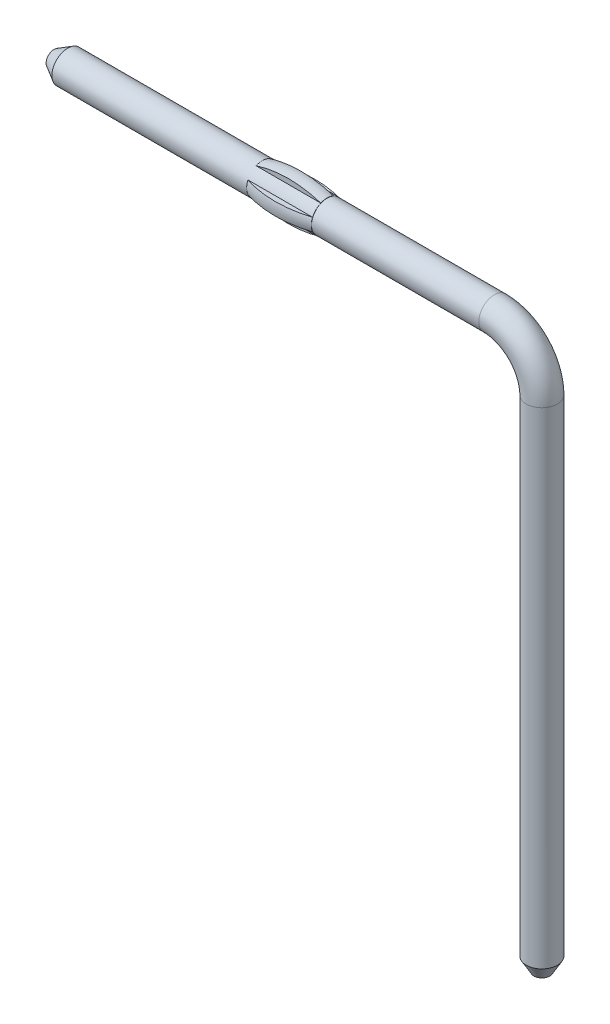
ISO-10303-21;
HEADER;
FILE_DESCRIPTION(('STEP AP214'),'2;1');
FILE_NAME('part.step','',(''),(''),'','','');
FILE_SCHEMA(('AUTOMOTIVE_DESIGN { 1 0 10303 214 1 1 1 1 }'));
ENDSEC;
DATA;
#1=APPLICATION_CONTEXT('core data for automotive mechanical design processes');
#2=APPLICATION_PROTOCOL_DEFINITION('international standard','automotive_design',2000,#1);
#3=PRODUCT_CONTEXT('',#1,'mechanical');
#4=PRODUCT('Part','Part','',(#3));
#5=PRODUCT_RELATED_PRODUCT_CATEGORY('part','',(#4));
#6=PRODUCT_DEFINITION_FORMATION('','',#4);
#7=PRODUCT_DEFINITION_CONTEXT('part definition',#1,'design');
#8=PRODUCT_DEFINITION('design','',#6,#7);
#9=PRODUCT_DEFINITION_SHAPE('','',#8);
#10=(LENGTH_UNIT() NAMED_UNIT(*) SI_UNIT(.MILLI.,.METRE.));
#11=(NAMED_UNIT(*) PLANE_ANGLE_UNIT() SI_UNIT($,.RADIAN.));
#12=(NAMED_UNIT(*) SI_UNIT($,.STERADIAN.) SOLID_ANGLE_UNIT());
#13=UNCERTAINTY_MEASURE_WITH_UNIT(LENGTH_MEASURE(1.E-05),#10,'distance_accuracy_value','');
#14=(GEOMETRIC_REPRESENTATION_CONTEXT(3) GLOBAL_UNCERTAINTY_ASSIGNED_CONTEXT((#13)) GLOBAL_UNIT_ASSIGNED_CONTEXT((#10,
#11,#12)) REPRESENTATION_CONTEXT('',''));
#15=CARTESIAN_POINT('',(0.,0.,0.));
#16=DIRECTION('',(0.,0.,1.));
#17=DIRECTION('',(1.,0.,0.));
#18=AXIS2_PLACEMENT_3D('',#15,#16,#17);
#19=CARTESIAN_POINT('',(-7.7,0.,0.));
#20=DIRECTION('',(1.,0.,0.));
#21=DIRECTION('',(0.,0.,-1.));
#22=AXIS2_PLACEMENT_3D('',#19,#20,#21);
#23=PLANE('',#22);
#24=CARTESIAN_POINT('',(-7.69999999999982,0.,0.));
#25=DIRECTION('',(1.,0.,0.));
#26=DIRECTION('',(0.,0.,-1.));
#27=AXIS2_PLACEMENT_3D('',#24,#25,#26);
#28=CIRCLE('',#27,0.12499999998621);
#29=CARTESIAN_POINT('',(-7.69999999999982,0.,-0.12499999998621));
#30=VERTEX_POINT('',#29);
#31=EDGE_CURVE('E21',#30,#30,#28,.T.);
#32=ORIENTED_EDGE('',*,*,#31,.F.);
#33=EDGE_LOOP('',(#32));
#34=FACE_BOUND('',#33,.T.);
#35=ADVANCED_FACE('F16',(#34),#23,.F.);
#36=CARTESIAN_POINT('',(-7.7,0.1,0.2291287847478));
#37=DIRECTION('',(0.,-1.,0.));
#38=DIRECTION('',(0.,0.,-1.));
#39=AXIS2_PLACEMENT_3D('',#36,#37,#38);
#40=PLANE('',#39);
#41=CARTESIAN_POINT('',(-3.39000000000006,0.1,0.229128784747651));
#42=CARTESIAN_POINT('',(-3.42100227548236,0.1,0.239288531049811));
#43=CARTESIAN_POINT('',(-3.45232127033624,0.1,0.248453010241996));
#44=CARTESIAN_POINT('',(-3.51545487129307,0.1,0.26483020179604));
#45=CARTESIAN_POINT('',(-3.54726930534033,0.1,0.272043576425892));
#46=CARTESIAN_POINT('',(-3.6435182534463,0.1,0.290870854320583));
#47=CARTESIAN_POINT('',(-3.7085269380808,0.1,0.299597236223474));
#48=CARTESIAN_POINT('',(-3.86808650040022,0.1,0.311579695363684));
#49=CARTESIAN_POINT('',(-3.96298668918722,0.1,0.310709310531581));
#50=CARTESIAN_POINT('',(-4.10398407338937,0.1,0.297494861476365));
#51=CARTESIAN_POINT('',(-4.15072624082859,0.1,0.29111365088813));
#52=CARTESIAN_POINT('',(-4.24348691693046,0.1,0.274376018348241));
#53=CARTESIAN_POINT('',(-4.28950587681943,0.1,0.264022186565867));
#54=CARTESIAN_POINT('',(-4.3601591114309,0.1,0.244758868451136));
#55=CARTESIAN_POINT('',(-4.385185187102,0.1,0.237261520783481));
#56=CARTESIAN_POINT('',(-4.41000000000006,0.1,0.22912878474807));
#57=B_SPLINE_CURVE_WITH_KNOTS('',3,(#41,#42,#43,#44,#45,#46,#47,#48,#49,#50,#51,#52,#53,#54,#55,
#56),.UNSPECIFIED.,.F.,.F.,(4,2,2,2,2,2,2,4),(0.,0.0978417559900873,0.19565025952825,
0.391991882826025,0.6751725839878,0.816569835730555,0.957875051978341,1.03621668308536),.UNSPECIFIED.);
#58=CARTESIAN_POINT('',(-3.39,0.0999999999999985,0.229128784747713));
#59=VERTEX_POINT('',#58);
#60=CARTESIAN_POINT('',(-4.40999999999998,0.0999999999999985,0.229128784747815));
#61=VERTEX_POINT('',#60);
#62=EDGE_CURVE('E118',#59,#61,#57,.T.);
#63=ORIENTED_EDGE('',*,*,#62,.F.);
#64=DIRECTION('',(1.,0.,0.));
#65=VECTOR('',#64,1.);
#66=CARTESIAN_POINT('',(-7.7,0.099999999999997,0.229128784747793));
#67=LINE('',#66,#65);
#68=EDGE_CURVE('E91',#61,#59,#67,.T.);
#69=ORIENTED_EDGE('',*,*,#68,.F.);
#70=EDGE_LOOP('',(#63,#69));
#71=FACE_BOUND('',#70,.T.);
#72=ADVANCED_FACE('F129',(#71),#40,.F.);
#73=CARTESIAN_POINT('',(-7.7,-0.1,0.2291287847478));
#74=DIRECTION('',(0.,-1.,0.));
#75=DIRECTION('',(0.,0.,-1.));
#76=AXIS2_PLACEMENT_3D('',#73,#74,#75);
#77=PLANE('',#76);
#78=DIRECTION('',(1.,0.,0.));
#79=VECTOR('',#78,1.);
#80=CARTESIAN_POINT('',(-7.7,-0.099999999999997,0.229128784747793));
#81=LINE('',#80,#79);
#82=CARTESIAN_POINT('',(-3.39,-0.0999999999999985,0.229128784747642));
#83=VERTEX_POINT('',#82);
#84=CARTESIAN_POINT('',(-4.40999999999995,-0.0999999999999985,0.229128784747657));
#85=VERTEX_POINT('',#84);
#86=EDGE_CURVE('E84',#83,#85,#81,.F.);
#87=ORIENTED_EDGE('',*,*,#86,.F.);
#88=CARTESIAN_POINT('',(-4.40999999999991,-0.1,0.22912878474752));
#89=CARTESIAN_POINT('',(-4.37899772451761,-0.1,0.239288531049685));
#90=CARTESIAN_POINT('',(-4.34767872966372,-0.1,0.248453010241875));
#91=CARTESIAN_POINT('',(-4.28454512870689,-0.1,0.264830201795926));
#92=CARTESIAN_POINT('',(-4.25273069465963,-0.1,0.272043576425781));
#93=CARTESIAN_POINT('',(-4.15648174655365,-0.1,0.290870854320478));
#94=CARTESIAN_POINT('',(-4.09147306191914,-0.1,0.299597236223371));
#95=CARTESIAN_POINT('',(-3.93191349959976,-0.1,0.311579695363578));
#96=CARTESIAN_POINT('',(-3.83701331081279,-0.1,0.310709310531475));
#97=CARTESIAN_POINT('',(-3.6960159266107,-0.1,0.297494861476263));
#98=CARTESIAN_POINT('',(-3.6492737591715,-0.1,0.29111365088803));
#99=CARTESIAN_POINT('',(-3.55651308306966,-0.1,0.274376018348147));
#100=CARTESIAN_POINT('',(-3.51049412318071,-0.1,0.264022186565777));
#101=CARTESIAN_POINT('',(-3.43984088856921,-0.1,0.244758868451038));
#102=CARTESIAN_POINT('',(-3.41481481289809,-0.1,0.237261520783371));
#103=CARTESIAN_POINT('',(-3.38999999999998,-0.1,0.229128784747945));
#104=B_SPLINE_CURVE_WITH_KNOTS('',3,(#88,#89,#90,#91,#92,#93,#94,#95,#96,#97,#98,#99,#100,#101,
#102,#103),.UNSPECIFIED.,.F.,.F.,(4,2,2,2,2,2,2,4),(0.,0.0978417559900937,0.195650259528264,
0.391991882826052,0.675172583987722,0.816569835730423,0.957875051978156,1.03621668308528),.UNSPECIFIED.);
#105=EDGE_CURVE('E87',#85,#83,#104,.T.);
#106=ORIENTED_EDGE('',*,*,#105,.F.);
#107=EDGE_LOOP('',(#87,#106));
#108=FACE_BOUND('',#107,.T.);
#109=ADVANCED_FACE('F85',(#108),#77,.T.);
#110=CARTESIAN_POINT('',(-7.7,-0.3092329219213,0.1));
#111=DIRECTION('',(0.,0.,1.));
#112=DIRECTION('',(1.,0.,0.));
#113=AXIS2_PLACEMENT_3D('',#110,#111,#112);
#114=PLANE('',#113);
#115=DIRECTION('',(1.,0.,0.));
#116=VECTOR('',#115,1.);
#117=CARTESIAN_POINT('',(-7.7,-0.229128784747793,0.0999999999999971));
#118=LINE('',#117,#116);
#119=CARTESIAN_POINT('',(-4.40999999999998,-0.229128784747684,0.0999999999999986));
#120=VERTEX_POINT('',#119);
#121=CARTESIAN_POINT('',(-3.39,-0.229128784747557,0.0999999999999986));
#122=VERTEX_POINT('',#121);
#123=EDGE_CURVE('E113',#120,#122,#118,.T.);
#124=ORIENTED_EDGE('',*,*,#123,.F.);
#125=CARTESIAN_POINT('',(-3.39000000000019,-0.229128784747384,0.1));
#126=CARTESIAN_POINT('',(-3.4210022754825,-0.239288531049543,0.1));
#127=CARTESIAN_POINT('',(-3.45232127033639,-0.248453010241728,0.1));
#128=CARTESIAN_POINT('',(-3.51545487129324,-0.264830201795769,0.1));
#129=CARTESIAN_POINT('',(-3.5472693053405,-0.27204357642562,0.1));
#130=CARTESIAN_POINT('',(-3.6435182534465,-0.290870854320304,0.1));
#131=CARTESIAN_POINT('',(-3.70852693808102,-0.29959723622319,0.1));
#132=CARTESIAN_POINT('',(-3.86808650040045,-0.31157969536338,0.1));
#133=CARTESIAN_POINT('',(-3.96298668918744,-0.310709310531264,0.1));
#134=CARTESIAN_POINT('',(-4.10398407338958,-0.297494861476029,0.1));
#135=CARTESIAN_POINT('',(-4.1507262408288,-0.291113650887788,0.1));
#136=CARTESIAN_POINT('',(-4.24348691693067,-0.274376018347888,0.1));
#137=CARTESIAN_POINT('',(-4.28950587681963,-0.264022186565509,0.1));
#138=CARTESIAN_POINT('',(-4.360159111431,-0.244758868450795,0.1));
#139=CARTESIAN_POINT('',(-4.385185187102,-0.237261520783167,0.1));
#140=CARTESIAN_POINT('',(-4.40999999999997,-0.229128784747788,0.1));
#141=B_SPLINE_CURVE_WITH_KNOTS('',3,(#125,#126,#127,#128,#129,#130,#131,#132,#133,#134,#135,
#136,#137,#138,#139,#140),.UNSPECIFIED.,.F.,.F.,(4,2,2,2,2,2,2,4),(0.,0.0978417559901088,
0.195650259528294,0.391991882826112,0.675172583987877,0.816569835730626,0.957875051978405,
1.03621668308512),.UNSPECIFIED.);
#142=EDGE_CURVE('E107',#122,#120,#141,.T.);
#143=ORIENTED_EDGE('',*,*,#142,.F.);
#144=EDGE_LOOP('',(#124,#143));
#145=FACE_BOUND('',#144,.T.);
#146=ADVANCED_FACE('F156',(#145),#114,.T.);
#147=CARTESIAN_POINT('',(-7.7,-0.3092329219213,-0.1));
#148=DIRECTION('',(0.,0.,1.));
#149=DIRECTION('',(1.,0.,0.));
#150=AXIS2_PLACEMENT_3D('',#147,#148,#149);
#151=PLANE('',#150);
#152=CARTESIAN_POINT('',(-4.40999999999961,-0.229128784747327,-0.1));
#153=CARTESIAN_POINT('',(-4.3789977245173,-0.23928853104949,-0.1));
#154=CARTESIAN_POINT('',(-4.34767872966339,-0.248453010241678,-0.1));
#155=CARTESIAN_POINT('',(-4.28454512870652,-0.264830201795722,-0.1));
#156=CARTESIAN_POINT('',(-4.25273069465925,-0.272043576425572,-0.1));
#157=CARTESIAN_POINT('',(-4.15648174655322,-0.290870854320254,-0.1));
#158=CARTESIAN_POINT('',(-4.09147306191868,-0.299597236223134,-0.1));
#159=CARTESIAN_POINT('',(-3.93191349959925,-0.311579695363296,-0.1));
#160=CARTESIAN_POINT('',(-3.83701331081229,-0.310709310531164,-0.1));
#161=CARTESIAN_POINT('',(-3.6960159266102,-0.29749486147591,-0.1));
#162=CARTESIAN_POINT('',(-3.649273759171,-0.291113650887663,-0.1));
#163=CARTESIAN_POINT('',(-3.55651308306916,-0.274376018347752,-0.1));
#164=CARTESIAN_POINT('',(-3.51049412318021,-0.264022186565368,-0.1));
#165=CARTESIAN_POINT('',(-3.43984088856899,-0.244758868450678,-0.1));
#166=CARTESIAN_POINT('',(-3.41481481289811,-0.237261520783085,-0.1));
#167=CARTESIAN_POINT('',(-3.39000000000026,-0.229128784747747,-0.1));
#168=B_SPLINE_CURVE_WITH_KNOTS('',3,(#152,#153,#154,#155,#156,#157,#158,#159,#160,#161,#162,
#163,#164,#165,#166,#167),.UNSPECIFIED.,.F.,.F.,(4,2,2,2,2,2,2,4),(0.,0.0978417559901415,
0.195650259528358,0.391991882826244,0.675172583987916,0.816569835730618,0.95787505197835,
1.03621668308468),.UNSPECIFIED.);
#169=CARTESIAN_POINT('',(-4.40999999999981,-0.22912878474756,-0.0999999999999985));
#170=VERTEX_POINT('',#169);
#171=CARTESIAN_POINT('',(-3.39000000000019,-0.229128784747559,-0.0999999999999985));
#172=VERTEX_POINT('',#171);
#173=EDGE_CURVE('E145',#170,#172,#168,.T.);
#174=ORIENTED_EDGE('',*,*,#173,.F.);
#175=DIRECTION('',(1.,0.,0.));
#176=VECTOR('',#175,1.);
#177=CARTESIAN_POINT('',(-7.7,-0.229128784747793,-0.0999999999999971));
#178=LINE('',#177,#176);
#179=EDGE_CURVE('E216',#172,#170,#178,.F.);
#180=ORIENTED_EDGE('',*,*,#179,.F.);
#181=EDGE_LOOP('',(#174,#180));
#182=FACE_BOUND('',#181,.T.);
#183=ADVANCED_FACE('F159',(#182),#151,.F.);
#184=CARTESIAN_POINT('',(-7.48349364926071,0.,0.));
#185=DIRECTION('',(1.,0.,0.));
#186=DIRECTION('',(0.,0.,-1.));
#187=AXIS2_PLACEMENT_3D('',#184,#185,#186);
#188=CONICAL_SURFACE('',#187,0.249999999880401,0.523598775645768);
#189=CARTESIAN_POINT('',(-7.483493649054,0.,0.));
#190=DIRECTION('',(1.,0.,0.));
#191=DIRECTION('',(0.,0.,-1.));
#192=AXIS2_PLACEMENT_3D('',#189,#190,#191);
#193=CIRCLE('',#192,0.25);
#194=CARTESIAN_POINT('',(-7.483493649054,0.,-0.25));
#195=VERTEX_POINT('',#194);
#196=EDGE_CURVE('E210',#195,#195,#193,.T.);
#197=ORIENTED_EDGE('',*,*,#196,.F.);
#198=EDGE_LOOP('',(#197));
#199=FACE_BOUND('',#198,.T.);
#200=ORIENTED_EDGE('',*,*,#31,.T.);
#201=EDGE_LOOP('',(#200));
#202=FACE_BOUND('',#201,.T.);
#203=ADVANCED_FACE('F296',(#199,#202),#188,.T.);
#204=CARTESIAN_POINT('',(-7.7,0.1,-0.2291287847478));
#205=DIRECTION('',(0.,1.,0.));
#206=DIRECTION('',(0.,0.,1.));
#207=AXIS2_PLACEMENT_3D('',#204,#205,#206);
#208=PLANE('',#207);
#209=DIRECTION('',(1.,0.,0.));
#210=VECTOR('',#209,1.);
#211=CARTESIAN_POINT('',(-7.7,0.0999999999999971,-0.229128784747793));
#212=LINE('',#211,#210);
#213=CARTESIAN_POINT('',(-3.39000000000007,0.0999999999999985,-0.229128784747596));
#214=VERTEX_POINT('',#213);
#215=CARTESIAN_POINT('',(-4.40999999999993,0.0999999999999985,-0.229128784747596));
#216=VERTEX_POINT('',#215);
#217=EDGE_CURVE('E209',#214,#216,#212,.F.);
#218=ORIENTED_EDGE('',*,*,#217,.F.);
#219=CARTESIAN_POINT('',(-4.40999999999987,0.1,-0.229128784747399));
#220=CARTESIAN_POINT('',(-4.37899772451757,0.1,-0.239288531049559));
#221=CARTESIAN_POINT('',(-4.34767872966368,0.1,-0.248453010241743));
#222=CARTESIAN_POINT('',(-4.28454512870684,0.1,-0.264830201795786));
#223=CARTESIAN_POINT('',(-4.25273069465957,0.1,-0.272043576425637));
#224=CARTESIAN_POINT('',(-4.15648174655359,0.1,-0.290870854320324));
#225=CARTESIAN_POINT('',(-4.09147306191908,0.1,-0.299597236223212));
#226=CARTESIAN_POINT('',(-3.93191349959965,0.1,-0.311579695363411));
#227=CARTESIAN_POINT('',(-3.83701331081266,0.1,-0.310709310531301));
#228=CARTESIAN_POINT('',(-3.69601592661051,0.1,-0.297494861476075));
#229=CARTESIAN_POINT('',(-3.64927375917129,0.1,-0.291113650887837));
#230=CARTESIAN_POINT('',(-3.55651308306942,0.1,-0.274376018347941));
#231=CARTESIAN_POINT('',(-3.51049412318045,0.1,-0.264022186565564));
#232=CARTESIAN_POINT('',(-3.43984088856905,0.1,-0.244758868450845));
#233=CARTESIAN_POINT('',(-3.41481481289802,0.1,-0.23726152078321));
#234=CARTESIAN_POINT('',(-3.39000000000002,0.1,-0.229128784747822));
#235=B_SPLINE_CURVE_WITH_KNOTS('',3,(#219,#220,#221,#222,#223,#224,#225,#226,#227,#228,#229,
#230,#231,#232,#233,#234),.UNSPECIFIED.,.F.,.F.,(4,2,2,2,2,2,2,4),(0.,0.0978417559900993,
0.195650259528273,0.391991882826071,0.675172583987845,0.816569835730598,0.957875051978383,
1.0362166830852),.UNSPECIFIED.);
#236=EDGE_CURVE('E220',#216,#214,#235,.T.);
#237=ORIENTED_EDGE('',*,*,#236,.F.);
#238=EDGE_LOOP('',(#218,#237));
#239=FACE_BOUND('',#238,.T.);
#240=ADVANCED_FACE('F271',(#239),#208,.T.);
#241=CARTESIAN_POINT('',(-7.7,-0.1,-0.2291287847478));
#242=DIRECTION('',(0.,1.,0.));
#243=DIRECTION('',(0.,0.,1.));
#244=AXIS2_PLACEMENT_3D('',#241,#242,#243);
#245=PLANE('',#244);
#246=CARTESIAN_POINT('',(-3.3900000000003,-0.1,-0.229128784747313));
#247=CARTESIAN_POINT('',(-3.42100227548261,-0.1,-0.239288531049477));
#248=CARTESIAN_POINT('',(-3.45232127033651,-0.1,-0.248453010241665));
#249=CARTESIAN_POINT('',(-3.51545487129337,-0.1,-0.264830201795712));
#250=CARTESIAN_POINT('',(-3.54726930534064,-0.1,-0.272043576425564));
#251=CARTESIAN_POINT('',(-3.64351825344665,-0.1,-0.29087085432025));
#252=CARTESIAN_POINT('',(-3.70852693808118,-0.1,-0.299597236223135));
#253=CARTESIAN_POINT('',(-3.8680865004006,-0.1,-0.31157969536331));
#254=CARTESIAN_POINT('',(-3.96298668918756,-0.1,-0.310709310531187));
#255=CARTESIAN_POINT('',(-4.10398407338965,-0.1,-0.297494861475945));
#256=CARTESIAN_POINT('',(-4.15072624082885,-0.1,-0.291113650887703));
#257=CARTESIAN_POINT('',(-4.24348691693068,-0.1,-0.274376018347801));
#258=CARTESIAN_POINT('',(-4.28950587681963,-0.1,-0.264022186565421));
#259=CARTESIAN_POINT('',(-4.36015911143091,-0.1,-0.244758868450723));
#260=CARTESIAN_POINT('',(-4.38518518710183,-0.1,-0.237261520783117));
#261=CARTESIAN_POINT('',(-4.40999999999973,-0.1,-0.229128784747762));
#262=B_SPLINE_CURVE_WITH_KNOTS('',3,(#246,#247,#248,#249,#250,#251,#252,#253,#254,#255,#256,
#257,#258,#259,#260,#261),.UNSPECIFIED.,.F.,.F.,(4,2,2,2,2,2,2,4),(0.,0.0978417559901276,
0.195650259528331,0.391991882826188,0.675172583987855,0.816569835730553,0.957875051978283,
1.03621668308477),.UNSPECIFIED.);
#263=CARTESIAN_POINT('',(-3.39000000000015,-0.0999999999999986,-0.229128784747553));
#264=VERTEX_POINT('',#263);
#265=CARTESIAN_POINT('',(-4.40999999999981,-0.0999999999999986,-0.229128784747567));
#266=VERTEX_POINT('',#265);
#267=EDGE_CURVE('E274',#264,#266,#262,.T.);
#268=ORIENTED_EDGE('',*,*,#267,.F.);
#269=DIRECTION('',(1.,0.,0.));
#270=VECTOR('',#269,1.);
#271=CARTESIAN_POINT('',(-7.7,-0.0999999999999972,-0.229128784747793));
#272=LINE('',#271,#270);
#273=EDGE_CURVE('E214',#266,#264,#272,.T.);
#274=ORIENTED_EDGE('',*,*,#273,.F.);
#275=EDGE_LOOP('',(#268,#274));
#276=FACE_BOUND('',#275,.T.);
#277=ADVANCED_FACE('F267',(#276),#245,.F.);
#278=CARTESIAN_POINT('',(-7.7,0.3092329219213,-0.1));
#279=DIRECTION('',(0.,0.,-1.));
#280=DIRECTION('',(-1.,0.,0.));
#281=AXIS2_PLACEMENT_3D('',#278,#279,#280);
#282=PLANE('',#281);
#283=DIRECTION('',(1.,0.,0.));
#284=VECTOR('',#283,1.);
#285=CARTESIAN_POINT('',(-7.7,0.229128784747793,-0.0999999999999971));
#286=LINE('',#285,#284);
#287=CARTESIAN_POINT('',(-4.40999999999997,0.229128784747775,-0.0999999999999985));
#288=VERTEX_POINT('',#287);
#289=CARTESIAN_POINT('',(-3.39000000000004,0.229128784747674,-0.0999999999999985));
#290=VERTEX_POINT('',#289);
#291=EDGE_CURVE('E207',#288,#290,#286,.T.);
#292=ORIENTED_EDGE('',*,*,#291,.F.);
#293=CARTESIAN_POINT('',(-3.39000000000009,0.229128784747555,-0.1));
#294=CARTESIAN_POINT('',(-3.42100227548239,0.23928853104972,-0.1));
#295=CARTESIAN_POINT('',(-3.45232127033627,0.248453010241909,-0.1));
#296=CARTESIAN_POINT('',(-3.51545487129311,0.26483020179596,-0.1));
#297=CARTESIAN_POINT('',(-3.54726930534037,0.272043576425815,-0.1));
#298=CARTESIAN_POINT('',(-3.64351825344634,0.290870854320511,-0.1));
#299=CARTESIAN_POINT('',(-3.70852693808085,0.299597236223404,-0.1));
#300=CARTESIAN_POINT('',(-3.86808650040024,0.311579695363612,-0.1));
#301=CARTESIAN_POINT('',(-3.96298668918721,0.310709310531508,-0.1));
#302=CARTESIAN_POINT('',(-4.1039840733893,0.297494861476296,-0.1));
#303=CARTESIAN_POINT('',(-4.15072624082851,0.291113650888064,-0.1));
#304=CARTESIAN_POINT('',(-4.24348691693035,0.27437601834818,-0.1));
#305=CARTESIAN_POINT('',(-4.2895058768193,0.264022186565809,-0.1));
#306=CARTESIAN_POINT('',(-4.3601591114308,0.24475886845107,-0.1));
#307=CARTESIAN_POINT('',(-4.38518518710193,0.237261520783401,-0.1));
#308=CARTESIAN_POINT('',(-4.41000000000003,0.229128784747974,-0.1));
#309=B_SPLINE_CURVE_WITH_KNOTS('',3,(#293,#294,#295,#296,#297,#298,#299,#300,#301,#302,#303,
#304,#305,#306,#307,#308),.UNSPECIFIED.,.F.,.F.,(4,2,2,2,2,2,2,4),(0.,0.0978417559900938,
0.195650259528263,0.39199188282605,0.675172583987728,0.816569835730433,0.95787505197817,
1.03621668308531),.UNSPECIFIED.);
#310=EDGE_CURVE('E35',#290,#288,#309,.T.);
#311=ORIENTED_EDGE('',*,*,#310,.F.);
#312=EDGE_LOOP('',(#292,#311));
#313=FACE_BOUND('',#312,.T.);
#314=ADVANCED_FACE('F262',(#313),#282,.T.);
#315=CARTESIAN_POINT('',(-7.7,0.3092329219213,0.1));
#316=DIRECTION('',(0.,0.,-1.));
#317=DIRECTION('',(-1.,0.,0.));
#318=AXIS2_PLACEMENT_3D('',#315,#316,#317);
#319=PLANE('',#318);
#320=CARTESIAN_POINT('',(-4.40999999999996,0.22912878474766,0.1));
#321=CARTESIAN_POINT('',(-4.37899772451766,0.239288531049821,0.1));
#322=CARTESIAN_POINT('',(-4.34767872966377,0.248453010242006,0.1));
#323=CARTESIAN_POINT('',(-4.28454512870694,0.264830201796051,0.1));
#324=CARTESIAN_POINT('',(-4.25273069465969,0.272043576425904,0.1));
#325=CARTESIAN_POINT('',(-4.15648174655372,0.290870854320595,0.1));
#326=CARTESIAN_POINT('',(-4.09147306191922,0.299597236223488,0.1));
#327=CARTESIAN_POINT('',(-3.9319134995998,0.311579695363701,0.1));
#328=CARTESIAN_POINT('',(-3.83701331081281,0.310709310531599,0.1));
#329=CARTESIAN_POINT('',(-3.69601592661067,0.297494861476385,0.1));
#330=CARTESIAN_POINT('',(-3.64927375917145,0.291113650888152,0.1));
#331=CARTESIAN_POINT('',(-3.55651308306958,0.274376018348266,0.1));
#332=CARTESIAN_POINT('',(-3.51049412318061,0.264022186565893,0.1));
#333=CARTESIAN_POINT('',(-3.43984088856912,0.24475886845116,0.1));
#334=CARTESIAN_POINT('',(-3.41481481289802,0.237261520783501,0.1));
#335=CARTESIAN_POINT('',(-3.38999999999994,0.229128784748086,0.1));
#336=B_SPLINE_CURVE_WITH_KNOTS('',3,(#320,#321,#322,#323,#324,#325,#326,#327,#328,#329,#330,
#331,#332,#333,#334,#335),.UNSPECIFIED.,.F.,.F.,(4,2,2,2,2,2,2,4),(0.,0.0978417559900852,
0.195650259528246,0.391991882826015,0.675172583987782,0.816569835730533,0.957875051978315,
1.03621668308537),.UNSPECIFIED.);
#337=CARTESIAN_POINT('',(-4.41,0.229128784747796,0.1));
#338=VERTEX_POINT('',#337);
#339=CARTESIAN_POINT('',(-3.39000000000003,0.229128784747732,0.1));
#340=VERTEX_POINT('',#339);
#341=EDGE_CURVE('E103',#338,#340,#336,.T.);
#342=ORIENTED_EDGE('',*,*,#341,.F.);
#343=DIRECTION('',(-1.,0.,0.));
#344=VECTOR('',#343,1.);
#345=CARTESIAN_POINT('',(-7.7,0.2291287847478,0.1));
#346=LINE('',#345,#344);
#347=EDGE_CURVE('E117',#340,#338,#346,.T.);
#348=ORIENTED_EDGE('',*,*,#347,.F.);
#349=EDGE_LOOP('',(#342,#348));
#350=FACE_BOUND('',#349,.T.);
#351=ADVANCED_FACE('F136',(#350),#319,.F.);
#352=CARTESIAN_POINT('',(-3.9,1.62847166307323E-13,1.37693675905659E-13));
#353=DIRECTION('',(1.,0.,0.));
#354=DIRECTION('',(0.,0.,-1.));
#355=AXIS2_PLACEMENT_3D('',#352,#353,#354);
#356=DEGENERATE_TOROIDAL_SURFACE('',#355,1.44649999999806,1.77149999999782,.F.);
#357=ORIENTED_EDGE('',*,*,#105,.T.);
#358=CARTESIAN_POINT('',(-3.39,1.62847166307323E-13,1.37693675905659E-13));
#359=DIRECTION('',(1.,0.,0.));
#360=DIRECTION('',(0.,0.,-1.));
#361=AXIS2_PLACEMENT_3D('',#358,#359,#360);
#362=CIRCLE('',#361,0.249999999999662);
#363=EDGE_CURVE('E94',#59,#83,#362,.T.);
#364=ORIENTED_EDGE('',*,*,#363,.F.);
#365=ORIENTED_EDGE('',*,*,#62,.T.);
#366=CARTESIAN_POINT('',(-4.40999999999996,1.39604582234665E-13,1.10900329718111E-13));
#367=DIRECTION('',(1.,0.,0.));
#368=DIRECTION('',(0.,1.,0.));
#369=AXIS2_PLACEMENT_3D('',#366,#367,#368);
#370=CIRCLE('',#369,0.249999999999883);
#371=EDGE_CURVE('E106',#61,#85,#370,.T.);
#372=ORIENTED_EDGE('',*,*,#371,.T.);
#373=EDGE_LOOP('',(#357,#364,#365,#372));
#374=FACE_BOUND('',#373,.T.);
#375=ADVANCED_FACE('F105',(#374),#356,.F.);
#376=CARTESIAN_POINT('',(-3.9,1.62847166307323E-13,1.37693675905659E-13));
#377=DIRECTION('',(1.,0.,0.));
#378=DIRECTION('',(0.,0.,-1.));
#379=AXIS2_PLACEMENT_3D('',#376,#377,#378);
#380=DEGENERATE_TOROIDAL_SURFACE('',#379,1.44649999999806,1.77149999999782,.F.);
#381=ORIENTED_EDGE('',*,*,#173,.T.);
#382=CARTESIAN_POINT('',(-3.39,1.62847166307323E-13,1.37693675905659E-13));
#383=DIRECTION('',(1.,0.,0.));
#384=DIRECTION('',(0.,0.,-1.));
#385=AXIS2_PLACEMENT_3D('',#382,#383,#384);
#386=CIRCLE('',#385,0.249999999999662);
#387=EDGE_CURVE('E102',#122,#172,#386,.T.);
#388=ORIENTED_EDGE('',*,*,#387,.F.);
#389=ORIENTED_EDGE('',*,*,#142,.T.);
#390=CARTESIAN_POINT('',(-4.41,0.,0.));
#391=DIRECTION('',(1.,0.,0.));
#392=DIRECTION('',(0.,0.,-1.));
#393=AXIS2_PLACEMENT_3D('',#390,#391,#392);
#394=CIRCLE('',#393,0.25);
#395=EDGE_CURVE('E219',#170,#120,#394,.F.);
#396=ORIENTED_EDGE('',*,*,#395,.F.);
#397=EDGE_LOOP('',(#381,#388,#389,#396));
#398=FACE_BOUND('',#397,.T.);
#399=ADVANCED_FACE('F135',(#398),#380,.F.);
#400=CARTESIAN_POINT('',(-3.9,1.62847166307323E-13,1.37693675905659E-13));
#401=DIRECTION('',(1.,0.,0.));
#402=DIRECTION('',(0.,0.,-1.));
#403=AXIS2_PLACEMENT_3D('',#400,#401,#402);
#404=DEGENERATE_TOROIDAL_SURFACE('',#403,1.44649999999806,1.77149999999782,.F.);
#405=ORIENTED_EDGE('',*,*,#236,.T.);
#406=CARTESIAN_POINT('',(-3.39000000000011,1.62847166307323E-13,1.37693675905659E-13));
#407=DIRECTION('',(1.,0.,0.));
#408=DIRECTION('',(0.,0.,-1.));
#409=AXIS2_PLACEMENT_3D('',#406,#407,#408);
#410=CIRCLE('',#409,0.249999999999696);
#411=EDGE_CURVE('E241',#264,#214,#410,.T.);
#412=ORIENTED_EDGE('',*,*,#411,.F.);
#413=ORIENTED_EDGE('',*,*,#267,.T.);
#414=CARTESIAN_POINT('',(-4.41,0.,0.));
#415=DIRECTION('',(1.,0.,0.));
#416=DIRECTION('',(0.,0.,-1.));
#417=AXIS2_PLACEMENT_3D('',#414,#415,#416);
#418=CIRCLE('',#417,0.25);
#419=EDGE_CURVE('E213',#216,#266,#418,.F.);
#420=ORIENTED_EDGE('',*,*,#419,.F.);
#421=EDGE_LOOP('',(#405,#412,#413,#420));
#422=FACE_BOUND('',#421,.T.);
#423=ADVANCED_FACE('F140',(#422),#404,.F.);
#424=CARTESIAN_POINT('',(-7.7,0.,0.));
#425=DIRECTION('',(1.,0.,0.));
#426=DIRECTION('',(0.,0.,-1.));
#427=AXIS2_PLACEMENT_3D('',#424,#425,#426);
#428=CYLINDRICAL_SURFACE('',#427,0.25);
#429=ORIENTED_EDGE('',*,*,#196,.T.);
#430=EDGE_LOOP('',(#429));
#431=FACE_BOUND('',#430,.T.);
#432=ORIENTED_EDGE('',*,*,#273,.T.);
#433=CARTESIAN_POINT('',(-3.39,0.,0.));
#434=DIRECTION('',(1.,0.,0.));
#435=DIRECTION('',(0.,0.,-1.));
#436=AXIS2_PLACEMENT_3D('',#433,#434,#435);
#437=CIRCLE('',#436,0.25);
#438=EDGE_CURVE('E244',#172,#264,#437,.T.);
#439=ORIENTED_EDGE('',*,*,#438,.F.);
#440=ORIENTED_EDGE('',*,*,#179,.T.);
#441=ORIENTED_EDGE('',*,*,#395,.T.);
#442=ORIENTED_EDGE('',*,*,#123,.T.);
#443=CARTESIAN_POINT('',(-3.39,0.,0.));
#444=DIRECTION('',(1.,0.,0.));
#445=DIRECTION('',(0.,0.,-1.));
#446=AXIS2_PLACEMENT_3D('',#443,#444,#445);
#447=CIRCLE('',#446,0.25);
#448=EDGE_CURVE('E79',#122,#83,#447,.F.);
#449=ORIENTED_EDGE('',*,*,#448,.T.);
#450=ORIENTED_EDGE('',*,*,#86,.T.);
#451=ORIENTED_EDGE('',*,*,#371,.F.);
#452=ORIENTED_EDGE('',*,*,#68,.T.);
#453=CARTESIAN_POINT('',(-3.39,0.,0.));
#454=DIRECTION('',(1.,0.,0.));
#455=DIRECTION('',(0.,0.,-1.));
#456=AXIS2_PLACEMENT_3D('',#453,#454,#455);
#457=CIRCLE('',#456,0.25);
#458=EDGE_CURVE('E98',#59,#340,#457,.F.);
#459=ORIENTED_EDGE('',*,*,#458,.T.);
#460=ORIENTED_EDGE('',*,*,#347,.T.);
#461=CARTESIAN_POINT('',(-4.40999999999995,1.38561037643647E-13,1.09585734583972E-13));
#462=DIRECTION('',(1.,0.,0.));
#463=DIRECTION('',(0.,1.,0.));
#464=AXIS2_PLACEMENT_3D('',#461,#462,#463);
#465=CIRCLE('',#464,0.249999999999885);
#466=EDGE_CURVE('E202',#288,#338,#465,.T.);
#467=ORIENTED_EDGE('',*,*,#466,.F.);
#468=ORIENTED_EDGE('',*,*,#291,.T.);
#469=CARTESIAN_POINT('',(-3.39,0.,0.));
#470=DIRECTION('',(1.,0.,0.));
#471=DIRECTION('',(0.,0.,-1.));
#472=AXIS2_PLACEMENT_3D('',#469,#470,#471);
#473=CIRCLE('',#472,0.25);
#474=EDGE_CURVE('E239',#214,#290,#473,.T.);
#475=ORIENTED_EDGE('',*,*,#474,.F.);
#476=ORIENTED_EDGE('',*,*,#217,.T.);
#477=ORIENTED_EDGE('',*,*,#419,.T.);
#478=EDGE_LOOP('',(#432,#439,#440,#441,#442,#449,#450,#451,#452,#459,#460,#467,#468,#475,#476,#477));
#479=FACE_BOUND('',#478,.T.);
#480=ADVANCED_FACE('F111',(#431,#479),#428,.T.);
#481=CARTESIAN_POINT('',(-3.9,1.62847166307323E-13,1.37693675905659E-13));
#482=DIRECTION('',(1.,0.,0.));
#483=DIRECTION('',(0.,0.,-1.));
#484=AXIS2_PLACEMENT_3D('',#481,#482,#483);
#485=DEGENERATE_TOROIDAL_SURFACE('',#484,1.44649999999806,1.77149999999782,.F.);
#486=ORIENTED_EDGE('',*,*,#341,.T.);
#487=CARTESIAN_POINT('',(-3.39,1.62847166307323E-13,1.37693675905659E-13));
#488=DIRECTION('',(1.,0.,0.));
#489=DIRECTION('',(0.,0.,-1.));
#490=AXIS2_PLACEMENT_3D('',#487,#488,#489);
#491=CIRCLE('',#490,0.249999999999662);
#492=EDGE_CURVE('E237',#290,#340,#491,.T.);
#493=ORIENTED_EDGE('',*,*,#492,.F.);
#494=ORIENTED_EDGE('',*,*,#310,.T.);
#495=ORIENTED_EDGE('',*,*,#466,.T.);
#496=EDGE_LOOP('',(#486,#493,#494,#495));
#497=FACE_BOUND('',#496,.T.);
#498=ADVANCED_FACE('F18',(#497),#485,.F.);
#499=CARTESIAN_POINT('',(-3.39,0.,0.));
#500=DIRECTION('',(1.,0.,0.));
#501=DIRECTION('',(0.,0.,-1.));
#502=AXIS2_PLACEMENT_3D('',#499,#500,#501);
#503=PLANE('',#502);
#504=CARTESIAN_POINT('',(-3.39,0.,0.));
#505=DIRECTION('',(1.,0.,0.));
#506=DIRECTION('',(0.,0.,-1.));
#507=AXIS2_PLACEMENT_3D('',#504,#505,#506);
#508=CIRCLE('',#507,0.246);
#509=CARTESIAN_POINT('',(-3.39,0.,-0.246));
#510=VERTEX_POINT('',#509);
#511=EDGE_CURVE('E201',#510,#510,#508,.T.);
#512=ORIENTED_EDGE('',*,*,#511,.F.);
#513=EDGE_LOOP('',(#512));
#514=FACE_BOUND('',#513,.T.);
#515=ORIENTED_EDGE('',*,*,#474,.T.);
#516=ORIENTED_EDGE('',*,*,#492,.T.);
#517=ORIENTED_EDGE('',*,*,#458,.F.);
#518=ORIENTED_EDGE('',*,*,#363,.T.);
#519=ORIENTED_EDGE('',*,*,#448,.F.);
#520=ORIENTED_EDGE('',*,*,#387,.T.);
#521=ORIENTED_EDGE('',*,*,#438,.T.);
#522=ORIENTED_EDGE('',*,*,#411,.T.);
#523=EDGE_LOOP('',(#515,#516,#517,#518,#519,#520,#521,#522));
#524=FACE_BOUND('',#523,.T.);
#525=ADVANCED_FACE('F96',(#514,#524),#503,.T.);
#526=CARTESIAN_POINT('',(-3.39,0.,0.));
#527=DIRECTION('',(1.,0.,0.));
#528=DIRECTION('',(0.,0.,-1.));
#529=AXIS2_PLACEMENT_3D('',#526,#527,#528);
#530=CYLINDRICAL_SURFACE('',#529,0.246);
#531=CARTESIAN_POINT('',(-0.75,0.,0.));
#532=DIRECTION('',(1.,0.,0.));
#533=DIRECTION('',(0.,1.,0.));
#534=AXIS2_PLACEMENT_3D('',#531,#532,#533);
#535=CIRCLE('',#534,0.246);
#536=CARTESIAN_POINT('',(-0.75,0.246,0.));
#537=VERTEX_POINT('',#536);
#538=EDGE_CURVE('E197',#537,#537,#535,.T.);
#539=ORIENTED_EDGE('',*,*,#538,.F.);
#540=EDGE_LOOP('',(#539));
#541=FACE_BOUND('',#540,.T.);
#542=ORIENTED_EDGE('',*,*,#511,.T.);
#543=EDGE_LOOP('',(#542));
#544=FACE_BOUND('',#543,.T.);
#545=ADVANCED_FACE('F191',(#541,#544),#530,.T.);
#546=CARTESIAN_POINT('',(-0.75,-0.75,0.));
#547=DIRECTION('',(0.,0.,-1.));
#548=DIRECTION('',(0.,-1.,0.));
#549=AXIS2_PLACEMENT_3D('',#546,#547,#548);
#550=TOROIDAL_SURFACE('',#549,0.75,0.246);
#551=CARTESIAN_POINT('',(0.,-0.75,0.));
#552=DIRECTION('',(0.,-1.,0.));
#553=DIRECTION('',(0.,0.,-1.));
#554=AXIS2_PLACEMENT_3D('',#551,#552,#553);
#555=CIRCLE('',#554,0.246);
#556=CARTESIAN_POINT('',(0.,-0.75,-0.246));
#557=VERTEX_POINT('',#556);
#558=EDGE_CURVE('E200',#557,#557,#555,.T.);
#559=ORIENTED_EDGE('',*,*,#558,.F.);
#560=EDGE_LOOP('',(#559));
#561=FACE_BOUND('',#560,.T.);
#562=ORIENTED_EDGE('',*,*,#538,.T.);
#563=EDGE_LOOP('',(#562));
#564=FACE_BOUND('',#563,.T.);
#565=ADVANCED_FACE('F186',(#561,#564),#550,.T.);
#566=CARTESIAN_POINT('',(0.,-8.63,0.));
#567=DIRECTION('',(0.,-1.,0.));
#568=DIRECTION('',(0.,0.,-1.));
#569=AXIS2_PLACEMENT_3D('',#566,#567,#568);
#570=PLANE('',#569);
#571=CARTESIAN_POINT('',(0.,-8.62999999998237,0.));
#572=DIRECTION('',(0.,1.,0.));
#573=DIRECTION('',(0.,0.,1.));
#574=AXIS2_PLACEMENT_3D('',#571,#572,#573);
#575=CIRCLE('',#574,0.125000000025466);
#576=CARTESIAN_POINT('',(0.,-8.62999999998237,0.125000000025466));
#577=VERTEX_POINT('',#576);
#578=EDGE_CURVE('E27',#577,#577,#575,.T.);
#579=ORIENTED_EDGE('',*,*,#578,.F.);
#580=EDGE_LOOP('',(#579));
#581=FACE_BOUND('',#580,.T.);
#582=ADVANCED_FACE('F178',(#581),#570,.T.);
#583=CARTESIAN_POINT('',(0.,-8.42042185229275,0.));
#584=DIRECTION('',(0.,1.,0.));
#585=DIRECTION('',(0.,0.,1.));
#586=AXIS2_PLACEMENT_3D('',#583,#584,#585);
#587=CONICAL_SURFACE('',#586,0.246000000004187,0.5235987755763);
#588=ORIENTED_EDGE('',*,*,#578,.T.);
#589=EDGE_LOOP('',(#588));
#590=FACE_BOUND('',#589,.T.);
#591=CARTESIAN_POINT('',(0.,-8.420421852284,0.));
#592=DIRECTION('',(0.,-1.,0.));
#593=DIRECTION('',(0.,0.,-1.));
#594=AXIS2_PLACEMENT_3D('',#591,#592,#593);
#595=CIRCLE('',#594,0.246);
#596=CARTESIAN_POINT('',(0.,-8.420421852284,-0.246));
#597=VERTEX_POINT('',#596);
#598=EDGE_CURVE('E11',#597,#597,#595,.F.);
#599=ORIENTED_EDGE('',*,*,#598,.F.);
#600=EDGE_LOOP('',(#599));
#601=FACE_BOUND('',#600,.T.);
#602=ADVANCED_FACE('F172',(#590,#601),#587,.T.);
#603=CARTESIAN_POINT('',(0.,-0.75,0.));
#604=DIRECTION('',(0.,-1.,0.));
#605=DIRECTION('',(0.,0.,-1.));
#606=AXIS2_PLACEMENT_3D('',#603,#604,#605);
#607=CYLINDRICAL_SURFACE('',#606,0.246);
#608=ORIENTED_EDGE('',*,*,#558,.T.);
#609=EDGE_LOOP('',(#608));
#610=FACE_BOUND('',#609,.T.);
#611=ORIENTED_EDGE('',*,*,#598,.T.);
#612=EDGE_LOOP('',(#611));
#613=FACE_BOUND('',#612,.T.);
#614=ADVANCED_FACE('F170',(#610,#613),#607,.T.);
#615=CLOSED_SHELL('',(#35,#72,#109,#146,#183,#203,#240,#277,#314,#351,#375,#399,#423,#480,#498,
#525,#545,#565,#582,#602,#614));
#616=MANIFOLD_SOLID_BREP('B1',#615);
#617=ADVANCED_BREP_SHAPE_REPRESENTATION('',(#18,#616),#14);
#618=SHAPE_DEFINITION_REPRESENTATION(#9,#617);
ENDSEC;
END-ISO-10303-21;
